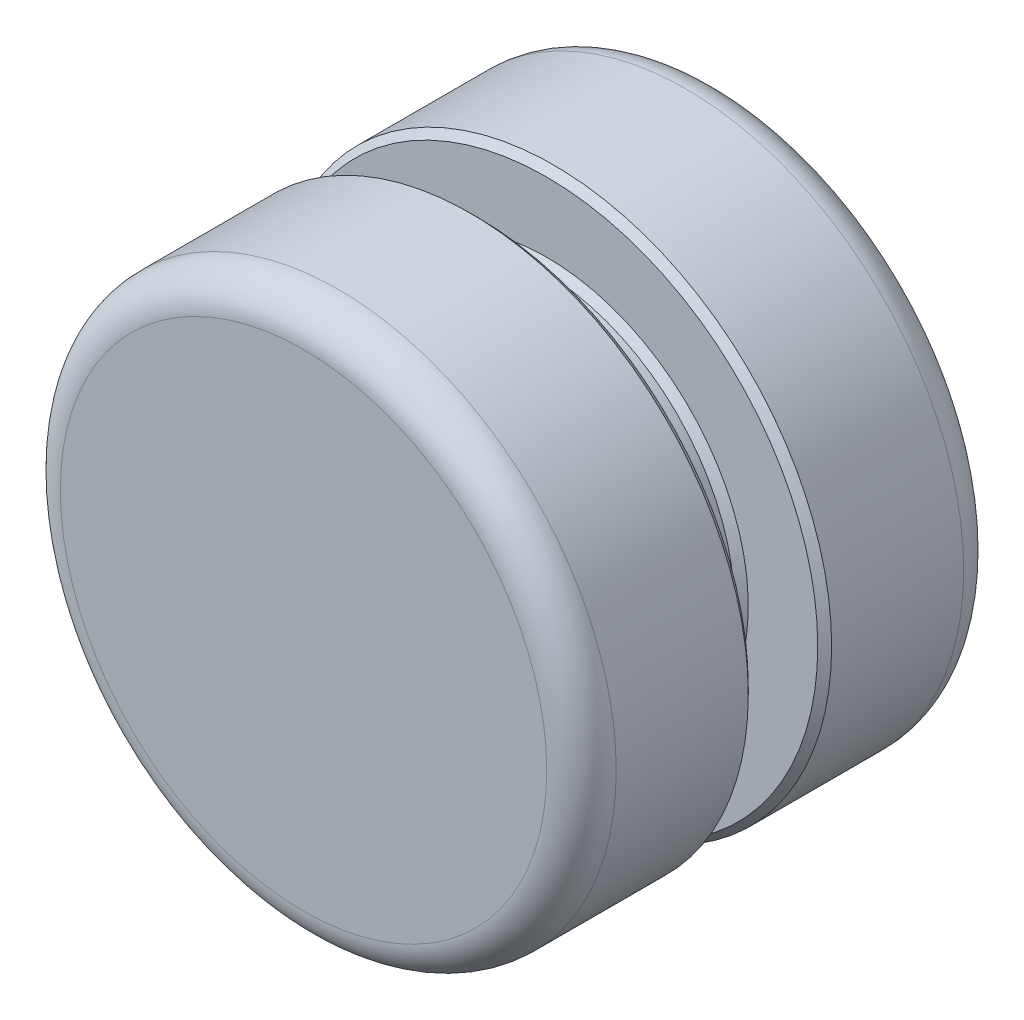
ISO-10303-21;
HEADER;
FILE_DESCRIPTION(('STEP AP214'),'2;1');
FILE_NAME('part.step','',(''),(''),'','','');
FILE_SCHEMA(('AUTOMOTIVE_DESIGN { 1 0 10303 214 1 1 1 1 }'));
ENDSEC;
DATA;
#1=APPLICATION_CONTEXT('core data for automotive mechanical design processes');
#2=APPLICATION_PROTOCOL_DEFINITION('international standard','automotive_design',2000,#1);
#3=PRODUCT_CONTEXT('',#1,'mechanical');
#4=PRODUCT('Part','Part','',(#3));
#5=PRODUCT_RELATED_PRODUCT_CATEGORY('part','',(#4));
#6=PRODUCT_DEFINITION_FORMATION('','',#4);
#7=PRODUCT_DEFINITION_CONTEXT('part definition',#1,'design');
#8=PRODUCT_DEFINITION('design','',#6,#7);
#9=PRODUCT_DEFINITION_SHAPE('','',#8);
#10=(LENGTH_UNIT() NAMED_UNIT(*) SI_UNIT(.MILLI.,.METRE.));
#11=(NAMED_UNIT(*) PLANE_ANGLE_UNIT() SI_UNIT($,.RADIAN.));
#12=(NAMED_UNIT(*) SI_UNIT($,.STERADIAN.) SOLID_ANGLE_UNIT());
#13=UNCERTAINTY_MEASURE_WITH_UNIT(LENGTH_MEASURE(1.E-05),#10,'distance_accuracy_value','');
#14=(GEOMETRIC_REPRESENTATION_CONTEXT(3) GLOBAL_UNCERTAINTY_ASSIGNED_CONTEXT((#13)) GLOBAL_UNIT_ASSIGNED_CONTEXT((#10,
#11,#12)) REPRESENTATION_CONTEXT('',''));
#15=CARTESIAN_POINT('',(0.,0.,0.));
#16=DIRECTION('',(0.,0.,1.));
#17=DIRECTION('',(1.,0.,0.));
#18=AXIS2_PLACEMENT_3D('',#15,#16,#17);
#19=CARTESIAN_POINT('',(0.,0.,0.5));
#20=DIRECTION('',(0.,0.,-1.));
#21=DIRECTION('',(-1.,0.,0.));
#22=AXIS2_PLACEMENT_3D('',#19,#20,#21);
#23=CYLINDRICAL_SURFACE('',#22,2.8);
#24=CARTESIAN_POINT('',(0.,0.,0.399999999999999));
#25=DIRECTION('',(0.,0.,1.));
#26=DIRECTION('',(1.,0.,0.));
#27=AXIS2_PLACEMENT_3D('',#24,#25,#26);
#28=CIRCLE('',#27,2.8);
#29=CARTESIAN_POINT('',(2.8,0.,0.399999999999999));
#30=VERTEX_POINT('',#29);
#31=EDGE_CURVE('E48',#30,#30,#28,.F.);
#32=ORIENTED_EDGE('',*,*,#31,.T.);
#33=EDGE_LOOP('',(#32));
#34=FACE_BOUND('',#33,.T.);
#35=CARTESIAN_POINT('',(0.,0.,-0.399999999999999));
#36=DIRECTION('',(0.,0.,-1.));
#37=DIRECTION('',(-1.,0.,0.));
#38=AXIS2_PLACEMENT_3D('',#35,#36,#37);
#39=CIRCLE('',#38,2.8);
#40=CARTESIAN_POINT('',(-2.8,0.,-0.399999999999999));
#41=VERTEX_POINT('',#40);
#42=EDGE_CURVE('E51',#41,#41,#39,.F.);
#43=ORIENTED_EDGE('',*,*,#42,.T.);
#44=EDGE_LOOP('',(#43));
#45=FACE_BOUND('',#44,.T.);
#46=ADVANCED_FACE('F28',(#34,#45),#23,.T.);
#47=CARTESIAN_POINT('',(0.,0.,0.5));
#48=DIRECTION('',(0.,0.,1.));
#49=DIRECTION('',(1.,0.,0.));
#50=AXIS2_PLACEMENT_3D('',#47,#48,#49);
#51=PLANE('',#50);
#52=CARTESIAN_POINT('',(0.,0.,0.5));
#53=DIRECTION('',(0.,0.,1.));
#54=DIRECTION('',(1.,0.,0.));
#55=AXIS2_PLACEMENT_3D('',#52,#53,#54);
#56=CIRCLE('',#55,2.9);
#57=CARTESIAN_POINT('',(2.9,0.,0.5));
#58=VERTEX_POINT('',#57);
#59=EDGE_CURVE('E54',#58,#58,#56,.T.);
#60=ORIENTED_EDGE('',*,*,#59,.T.);
#61=EDGE_LOOP('',(#60));
#62=FACE_BOUND('',#61,.T.);
#63=CARTESIAN_POINT('',(0.,0.,0.5));
#64=DIRECTION('',(0.,0.,1.));
#65=DIRECTION('',(1.,0.,0.));
#66=AXIS2_PLACEMENT_3D('',#63,#64,#65);
#67=CIRCLE('',#66,3.9);
#68=CARTESIAN_POINT('',(3.9,0.,0.5));
#69=VERTEX_POINT('',#68);
#70=EDGE_CURVE('E57',#69,#69,#67,.F.);
#71=ORIENTED_EDGE('',*,*,#70,.T.);
#72=EDGE_LOOP('',(#71));
#73=FACE_BOUND('',#72,.T.);
#74=ADVANCED_FACE('F93',(#62,#73),#51,.F.);
#75=CARTESIAN_POINT('',(0.,0.,3.));
#76=DIRECTION('',(0.,0.,-1.));
#77=DIRECTION('',(-1.,0.,0.));
#78=AXIS2_PLACEMENT_3D('',#75,#76,#77);
#79=CYLINDRICAL_SURFACE('',#78,4.);
#80=CARTESIAN_POINT('',(0.,0.,0.600000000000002));
#81=DIRECTION('',(0.,0.,1.));
#82=DIRECTION('',(1.,0.,0.));
#83=AXIS2_PLACEMENT_3D('',#80,#81,#82);
#84=CIRCLE('',#83,4.);
#85=CARTESIAN_POINT('',(4.,0.,0.600000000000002));
#86=VERTEX_POINT('',#85);
#87=EDGE_CURVE('E43',#86,#86,#84,.T.);
#88=ORIENTED_EDGE('',*,*,#87,.T.);
#89=EDGE_LOOP('',(#88));
#90=FACE_BOUND('',#89,.T.);
#91=CARTESIAN_POINT('',(0.,0.,2.5));
#92=DIRECTION('',(0.,0.,1.));
#93=DIRECTION('',(1.,0.,0.));
#94=AXIS2_PLACEMENT_3D('',#91,#92,#93);
#95=CIRCLE('',#94,4.);
#96=CARTESIAN_POINT('',(4.,0.,2.5));
#97=VERTEX_POINT('',#96);
#98=EDGE_CURVE('E60',#97,#97,#95,.F.);
#99=ORIENTED_EDGE('',*,*,#98,.T.);
#100=EDGE_LOOP('',(#99));
#101=FACE_BOUND('',#100,.T.);
#102=ADVANCED_FACE('F98',(#90,#101),#79,.T.);
#103=CARTESIAN_POINT('',(0.,0.,3.));
#104=DIRECTION('',(0.,0.,1.));
#105=DIRECTION('',(1.,0.,0.));
#106=AXIS2_PLACEMENT_3D('',#103,#104,#105);
#107=PLANE('',#106);
#108=CARTESIAN_POINT('',(0.,0.,3.));
#109=DIRECTION('',(0.,0.,1.));
#110=DIRECTION('',(1.,0.,0.));
#111=AXIS2_PLACEMENT_3D('',#108,#109,#110);
#112=CIRCLE('',#111,3.5);
#113=CARTESIAN_POINT('',(3.5,0.,3.));
#114=VERTEX_POINT('',#113);
#115=EDGE_CURVE('E63',#114,#114,#112,.T.);
#116=ORIENTED_EDGE('',*,*,#115,.T.);
#117=EDGE_LOOP('',(#116));
#118=FACE_BOUND('',#117,.T.);
#119=ADVANCED_FACE('F104',(#118),#107,.T.);
#120=CARTESIAN_POINT('',(0.,0.,-0.5));
#121=DIRECTION('',(0.,0.,-1.));
#122=DIRECTION('',(1.,0.,0.));
#123=AXIS2_PLACEMENT_3D('',#120,#121,#122);
#124=PLANE('',#123);
#125=CARTESIAN_POINT('',(0.,0.,-0.5));
#126=DIRECTION('',(0.,0.,-1.));
#127=DIRECTION('',(-1.,0.,0.));
#128=AXIS2_PLACEMENT_3D('',#125,#126,#127);
#129=CIRCLE('',#128,2.9);
#130=CARTESIAN_POINT('',(-2.9,0.,-0.5));
#131=VERTEX_POINT('',#130);
#132=EDGE_CURVE('E35',#131,#131,#129,.T.);
#133=ORIENTED_EDGE('',*,*,#132,.T.);
#134=EDGE_LOOP('',(#133));
#135=FACE_BOUND('',#134,.T.);
#136=CARTESIAN_POINT('',(0.,0.,-0.5));
#137=DIRECTION('',(0.,0.,-1.));
#138=DIRECTION('',(-1.,0.,0.));
#139=AXIS2_PLACEMENT_3D('',#136,#137,#138);
#140=CIRCLE('',#139,3.9);
#141=CARTESIAN_POINT('',(-3.9,0.,-0.5));
#142=VERTEX_POINT('',#141);
#143=EDGE_CURVE('E39',#142,#142,#140,.F.);
#144=ORIENTED_EDGE('',*,*,#143,.T.);
#145=EDGE_LOOP('',(#144));
#146=FACE_BOUND('',#145,.T.);
#147=ADVANCED_FACE('F109',(#135,#146),#124,.F.);
#148=CARTESIAN_POINT('',(0.,0.,-3.));
#149=DIRECTION('',(0.,0.,1.));
#150=DIRECTION('',(-1.,0.,0.));
#151=AXIS2_PLACEMENT_3D('',#148,#149,#150);
#152=CYLINDRICAL_SURFACE('',#151,4.);
#153=CARTESIAN_POINT('',(0.,0.,-0.599999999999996));
#154=DIRECTION('',(0.,0.,-1.));
#155=DIRECTION('',(-1.,0.,0.));
#156=AXIS2_PLACEMENT_3D('',#153,#154,#155);
#157=CIRCLE('',#156,4.);
#158=CARTESIAN_POINT('',(-4.,0.,-0.599999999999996));
#159=VERTEX_POINT('',#158);
#160=EDGE_CURVE('E10',#159,#159,#157,.T.);
#161=ORIENTED_EDGE('',*,*,#160,.T.);
#162=EDGE_LOOP('',(#161));
#163=FACE_BOUND('',#162,.T.);
#164=CARTESIAN_POINT('',(0.,0.,-2.5));
#165=DIRECTION('',(0.,0.,-1.));
#166=DIRECTION('',(-1.,0.,0.));
#167=AXIS2_PLACEMENT_3D('',#164,#165,#166);
#168=CIRCLE('',#167,4.);
#169=CARTESIAN_POINT('',(-4.,0.,-2.5));
#170=VERTEX_POINT('',#169);
#171=EDGE_CURVE('E69',#170,#170,#168,.F.);
#172=ORIENTED_EDGE('',*,*,#171,.T.);
#173=EDGE_LOOP('',(#172));
#174=FACE_BOUND('',#173,.T.);
#175=ADVANCED_FACE('F73',(#163,#174),#152,.T.);
#176=CARTESIAN_POINT('',(0.,0.,-3.));
#177=DIRECTION('',(0.,0.,-1.));
#178=DIRECTION('',(1.,0.,0.));
#179=AXIS2_PLACEMENT_3D('',#176,#177,#178);
#180=PLANE('',#179);
#181=CARTESIAN_POINT('',(0.,0.,-3.));
#182=DIRECTION('',(0.,0.,-1.));
#183=DIRECTION('',(-1.,0.,0.));
#184=AXIS2_PLACEMENT_3D('',#181,#182,#183);
#185=CIRCLE('',#184,3.5);
#186=CARTESIAN_POINT('',(-3.5,0.,-3.));
#187=VERTEX_POINT('',#186);
#188=EDGE_CURVE('E66',#187,#187,#185,.T.);
#189=ORIENTED_EDGE('',*,*,#188,.T.);
#190=EDGE_LOOP('',(#189));
#191=FACE_BOUND('',#190,.T.);
#192=ADVANCED_FACE('F78',(#191),#180,.T.);
#193=CARTESIAN_POINT('',(0.,0.,-2.5));
#194=DIRECTION('',(0.,0.,-1.));
#195=DIRECTION('',(-1.,0.,0.));
#196=AXIS2_PLACEMENT_3D('',#193,#194,#195);
#197=TOROIDAL_SURFACE('',#196,3.5,0.5);
#198=ORIENTED_EDGE('',*,*,#188,.F.);
#199=EDGE_LOOP('',(#198));
#200=FACE_BOUND('',#199,.T.);
#201=ORIENTED_EDGE('',*,*,#171,.F.);
#202=EDGE_LOOP('',(#201));
#203=FACE_BOUND('',#202,.T.);
#204=ADVANCED_FACE('F75',(#200,#203),#197,.T.);
#205=CARTESIAN_POINT('',(0.,0.,2.5));
#206=DIRECTION('',(0.,0.,1.));
#207=DIRECTION('',(1.,0.,0.));
#208=AXIS2_PLACEMENT_3D('',#205,#206,#207);
#209=TOROIDAL_SURFACE('',#208,3.5,0.5);
#210=ORIENTED_EDGE('',*,*,#98,.F.);
#211=EDGE_LOOP('',(#210));
#212=FACE_BOUND('',#211,.T.);
#213=ORIENTED_EDGE('',*,*,#115,.F.);
#214=EDGE_LOOP('',(#213));
#215=FACE_BOUND('',#214,.T.);
#216=ADVANCED_FACE('F77',(#212,#215),#209,.T.);
#217=CARTESIAN_POINT('',(0.,0.,0.5));
#218=DIRECTION('',(0.,0.,1.));
#219=DIRECTION('',(1.,0.,0.));
#220=AXIS2_PLACEMENT_3D('',#217,#218,#219);
#221=CONICAL_SURFACE('',#220,2.9,0.785398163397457);
#222=ORIENTED_EDGE('',*,*,#31,.F.);
#223=EDGE_LOOP('',(#222));
#224=FACE_BOUND('',#223,.T.);
#225=ORIENTED_EDGE('',*,*,#59,.F.);
#226=EDGE_LOOP('',(#225));
#227=FACE_BOUND('',#226,.T.);
#228=ADVANCED_FACE('F85',(#224,#227),#221,.T.);
#229=CARTESIAN_POINT('',(0.,0.,0.600000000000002));
#230=DIRECTION('',(0.,0.,1.));
#231=DIRECTION('',(1.,0.,0.));
#232=AXIS2_PLACEMENT_3D('',#229,#230,#231);
#233=CONICAL_SURFACE('',#232,4.,0.78539816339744);
#234=ORIENTED_EDGE('',*,*,#70,.F.);
#235=EDGE_LOOP('',(#234));
#236=FACE_BOUND('',#235,.T.);
#237=ORIENTED_EDGE('',*,*,#87,.F.);
#238=EDGE_LOOP('',(#237));
#239=FACE_BOUND('',#238,.T.);
#240=ADVANCED_FACE('F125',(#236,#239),#233,.T.);
#241=CARTESIAN_POINT('',(0.,0.,-0.399999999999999));
#242=DIRECTION('',(0.,0.,-1.));
#243=DIRECTION('',(-1.,0.,0.));
#244=AXIS2_PLACEMENT_3D('',#241,#242,#243);
#245=CONICAL_SURFACE('',#244,2.8,0.785398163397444);
#246=ORIENTED_EDGE('',*,*,#132,.F.);
#247=EDGE_LOOP('',(#246));
#248=FACE_BOUND('',#247,.T.);
#249=ORIENTED_EDGE('',*,*,#42,.F.);
#250=EDGE_LOOP('',(#249));
#251=FACE_BOUND('',#250,.T.);
#252=ADVANCED_FACE('F120',(#248,#251),#245,.T.);
#253=CARTESIAN_POINT('',(0.,0.,-0.5));
#254=DIRECTION('',(0.,0.,-1.));
#255=DIRECTION('',(-1.,0.,0.));
#256=AXIS2_PLACEMENT_3D('',#253,#254,#255);
#257=CONICAL_SURFACE('',#256,3.9,0.785398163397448);
#258=ORIENTED_EDGE('',*,*,#160,.F.);
#259=EDGE_LOOP('',(#258));
#260=FACE_BOUND('',#259,.T.);
#261=ORIENTED_EDGE('',*,*,#143,.F.);
#262=EDGE_LOOP('',(#261));
#263=FACE_BOUND('',#262,.T.);
#264=ADVANCED_FACE('F30',(#260,#263),#257,.T.);
#265=CLOSED_SHELL('',(#46,#74,#102,#119,#147,#175,#192,#204,#216,#228,#240,#252,#264));
#266=MANIFOLD_SOLID_BREP('B2',#265);
#267=ADVANCED_BREP_SHAPE_REPRESENTATION('',(#18,#266),#14);
#268=SHAPE_DEFINITION_REPRESENTATION(#9,#267);
ENDSEC;
END-ISO-10303-21;
